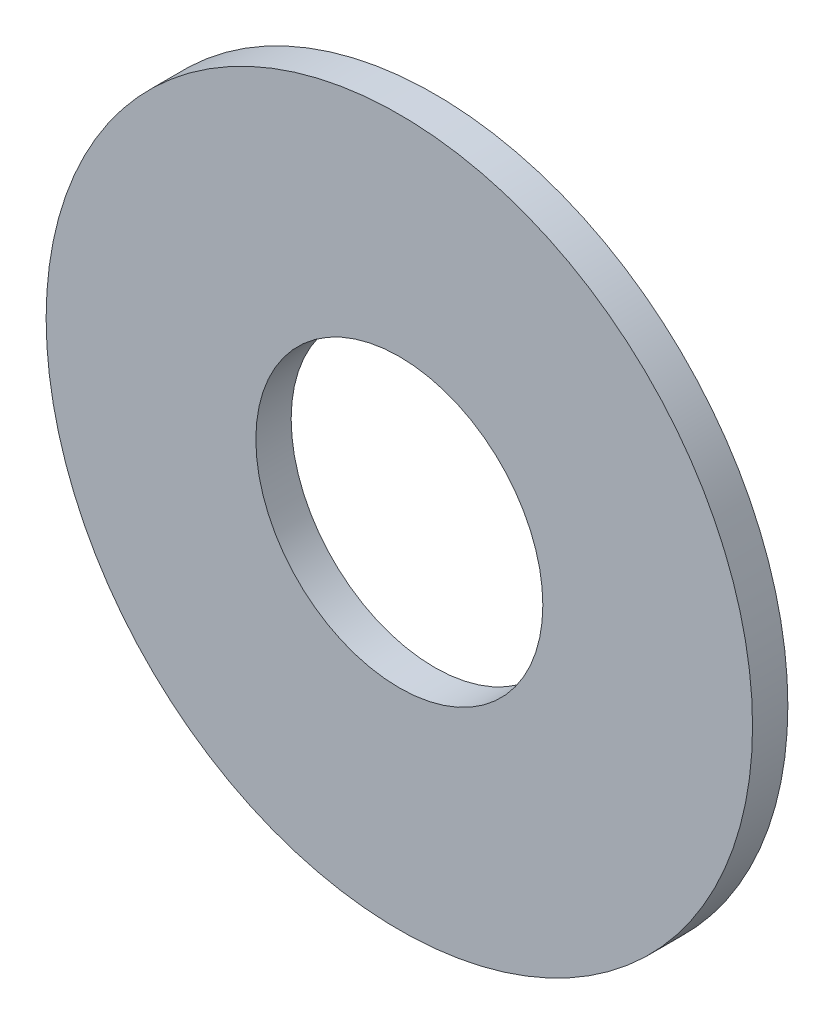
from build123d import *

# Parameters (mm, degrees)
SKETCH2_R          = 25.4
EXTRUDE1_DEPTH     = 2.54
SKETCH3_R          = 10.31875
CUT_EXTRUDE1_DEPTH = 2.54


with BuildPart() as part:
    # Sketch2 → Extrude1 (new body)
    with BuildSketch(Plane.XY):
        Circle(SKETCH2_R)
    extrude(amount=EXTRUDE1_DEPTH)

    # Sketch3 → Cut-Extrude1 (cut)
    with BuildSketch(Plane.XY.offset(2.54)):
        Circle(SKETCH3_R)
    extrude(amount=-CUT_EXTRUDE1_DEPTH, mode=Mode.SUBTRACT)


solid = part.part
